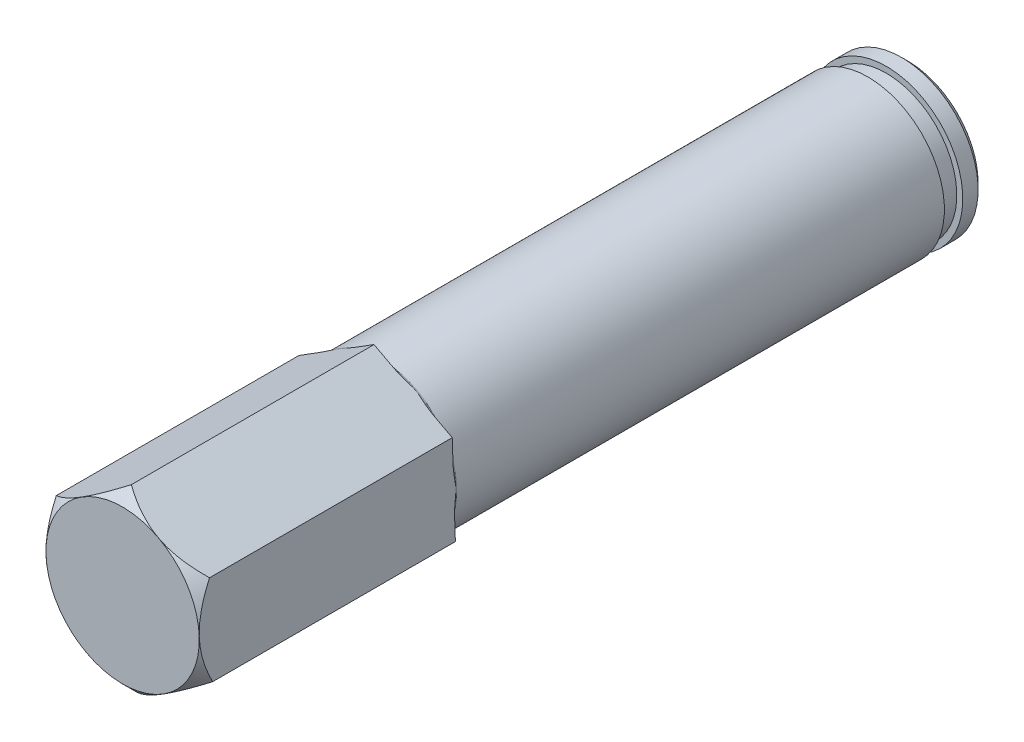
from build123d import *

# Parameters (mm, degrees)
BOSS_EXTRUDE1_DEPTH = 32.512


with BuildPart() as part:
    # Sketch1 → Boss-Extrude1 (new body)
    with BuildSketch(Plane.XY):
        Polygon((-0.130187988, 3.663861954), (-3.238091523, 1.719184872), (-3.107903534, -1.944677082), (0.130187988, -3.663861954), (3.238091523, -1.719184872), (3.107903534, 1.944677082), align=None)
    extrude(amount=-BOSS_EXTRUDE1_DEPTH)

    # Sketch4 → Cut-Revolve1 (revolve, cut)
    with BuildSketch(Plane.XZ):
        Polygon((-3.175, 0), (-4.16822152, -0.99322152), (-4.16822152, 0), align=None)
        with BuildLine():
            Line((-2.91465, -32.512), (-3.16865, -32.258))
            Line((-3.16865, -32.258), (-3.16865, -31.623))
            Line((-3.16865, -31.623), (-2.921, -31.623))
            Line((-2.921, -31.623), (-2.921, -30.861))
            Line((-2.921, -30.861), (-3.16865, -30.861))
            Line((-3.16865, -30.861), (-3.16865, -24.892))
            Line((-3.16865, -24.892), (-3.16865, -16.09852))
            Line((-3.16865, -16.09852), (-3.16865, -10.668))
            ThreePointArc((-3.16865, -10.668), (-3.205847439, -10.578197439), (-3.29565, -10.541))
            Line((-3.29565, -10.541), (-5.227784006, -10.541))
            Line((-5.227784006, -10.541), (-5.227784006, -32.512))
            Line((-5.227784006, -32.512), (-2.91465, -32.512))
        make_face()
    revolve(axis=Axis((0, 0, -32.512), (0, 0, 1)), mode=Mode.SUBTRACT)


solid = part.part
